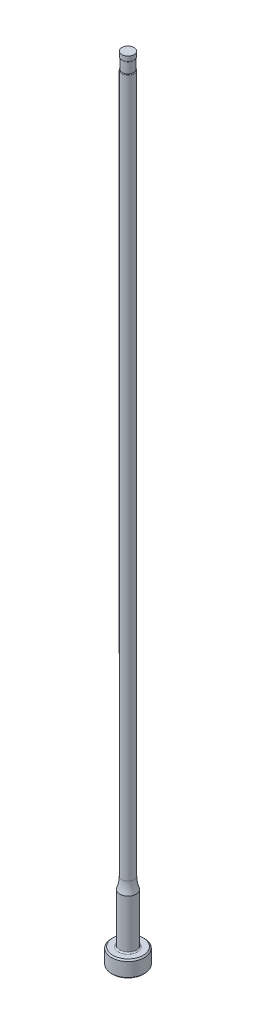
ISO-10303-21;
HEADER;
FILE_DESCRIPTION(('STEP AP214'),'2;1');
FILE_NAME('part.step','',(''),(''),'','','');
FILE_SCHEMA(('AUTOMOTIVE_DESIGN { 1 0 10303 214 1 1 1 1 }'));
ENDSEC;
DATA;
#1=APPLICATION_CONTEXT('core data for automotive mechanical design processes');
#2=APPLICATION_PROTOCOL_DEFINITION('international standard','automotive_design',2000,#1);
#3=PRODUCT_CONTEXT('',#1,'mechanical');
#4=PRODUCT('Part','Part','',(#3));
#5=PRODUCT_RELATED_PRODUCT_CATEGORY('part','',(#4));
#6=PRODUCT_DEFINITION_FORMATION('','',#4);
#7=PRODUCT_DEFINITION_CONTEXT('part definition',#1,'design');
#8=PRODUCT_DEFINITION('design','',#6,#7);
#9=PRODUCT_DEFINITION_SHAPE('','',#8);
#10=(LENGTH_UNIT() NAMED_UNIT(*) SI_UNIT(.MILLI.,.METRE.));
#11=(NAMED_UNIT(*) PLANE_ANGLE_UNIT() SI_UNIT($,.RADIAN.));
#12=(NAMED_UNIT(*) SI_UNIT($,.STERADIAN.) SOLID_ANGLE_UNIT());
#13=UNCERTAINTY_MEASURE_WITH_UNIT(LENGTH_MEASURE(1.E-05),#10,'distance_accuracy_value','');
#14=(GEOMETRIC_REPRESENTATION_CONTEXT(3) GLOBAL_UNCERTAINTY_ASSIGNED_CONTEXT((#13)) GLOBAL_UNIT_ASSIGNED_CONTEXT((#10,
#11,#12)) REPRESENTATION_CONTEXT('',''));
#15=CARTESIAN_POINT('',(0.,0.,0.));
#16=DIRECTION('',(0.,0.,1.));
#17=DIRECTION('',(1.,0.,0.));
#18=AXIS2_PLACEMENT_3D('',#15,#16,#17);
#19=CARTESIAN_POINT('',(0.,259.958771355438,0.));
#20=DIRECTION('',(0.,1.,0.));
#21=DIRECTION('',(0.,0.,1.));
#22=AXIS2_PLACEMENT_3D('',#19,#20,#21);
#23=CYLINDRICAL_SURFACE('',#22,1.18998999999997);
#24=DIRECTION('',(0.,1.,0.));
#25=VECTOR('',#24,1.);
#26=CARTESIAN_POINT('',(-1.08838999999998,259.958771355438,-0.481127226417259));
#27=LINE('',#26,#25);
#28=CARTESIAN_POINT('',(-1.08838999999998,149.227565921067,-0.481127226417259));
#29=VERTEX_POINT('',#28);
#30=CARTESIAN_POINT('',(-1.08838999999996,112.268,-0.481127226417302));
#31=VERTEX_POINT('',#30);
#32=EDGE_CURVE('E66',#29,#31,#27,.F.);
#33=ORIENTED_EDGE('',*,*,#32,.F.);
#34=CARTESIAN_POINT('',(0.,149.227565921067,0.));
#35=DIRECTION('',(0.,1.,0.));
#36=DIRECTION('',(0.,0.,1.));
#37=AXIS2_PLACEMENT_3D('',#34,#35,#36);
#38=CIRCLE('',#37,1.18998999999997);
#39=CARTESIAN_POINT('',(-1.08838999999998,149.227565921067,0.481127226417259));
#40=VERTEX_POINT('',#39);
#41=EDGE_CURVE('E44',#29,#40,#38,.F.);
#42=ORIENTED_EDGE('',*,*,#41,.T.);
#43=DIRECTION('',(0.,1.,0.));
#44=VECTOR('',#43,1.);
#45=CARTESIAN_POINT('',(-1.08838999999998,259.958771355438,0.481127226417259));
#46=LINE('',#45,#44);
#47=CARTESIAN_POINT('',(-1.08838999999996,112.268,0.481127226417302));
#48=VERTEX_POINT('',#47);
#49=EDGE_CURVE('E72',#48,#40,#46,.T.);
#50=ORIENTED_EDGE('',*,*,#49,.F.);
#51=CARTESIAN_POINT('',(-1.08838999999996,112.268,-0.481127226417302));
#52=CARTESIAN_POINT('',(-1.08838966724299,112.239183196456,-0.481120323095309));
#53=CARTESIAN_POINT('',(-1.08878297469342,112.210379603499,-0.480240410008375));
#54=CARTESIAN_POINT('',(-1.0903471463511,112.15287486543,-0.476680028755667));
#55=CARTESIAN_POINT('',(-1.09151883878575,112.124173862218,-0.473997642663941));
#56=CARTESIAN_POINT('',(-1.0962236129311,112.037732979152,-0.463079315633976));
#57=CARTESIAN_POINT('',(-1.10094613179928,111.980365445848,-0.451969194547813));
#58=CARTESIAN_POINT('',(-1.11171709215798,111.881397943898,-0.424640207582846));
#59=CARTESIAN_POINT('',(-1.11720060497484,111.839237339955,-0.41021369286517));
#60=CARTESIAN_POINT('',(-1.12939077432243,111.75775729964,-0.375363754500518));
#61=CARTESIAN_POINT('',(-1.13609165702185,111.71842562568,-0.354968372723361));
#62=CARTESIAN_POINT('',(-1.1472645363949,111.658969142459,-0.316366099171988));
#63=CARTESIAN_POINT('',(-1.15158336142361,111.637348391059,-0.300422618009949));
#64=CARTESIAN_POINT('',(-1.16012072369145,111.596602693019,-0.265553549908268));
#65=CARTESIAN_POINT('',(-1.16433935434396,111.577475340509,-0.246630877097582));
#66=CARTESIAN_POINT('',(-1.17139417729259,111.546625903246,-0.210179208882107));
#67=CARTESIAN_POINT('',(-1.17432972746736,111.534201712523,-0.193268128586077));
#68=CARTESIAN_POINT('',(-1.17964378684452,111.512180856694,-0.157607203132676));
#69=CARTESIAN_POINT('',(-1.18202305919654,111.502580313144,-0.138859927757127));
#70=CARTESIAN_POINT('',(-1.1856222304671,111.488246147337,-0.103155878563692));
#71=CARTESIAN_POINT('',(-1.1869702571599,111.482963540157,-0.0864338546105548));
#72=CARTESIAN_POINT('',(-1.18896221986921,111.475197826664,-0.05230931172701));
#73=CARTESIAN_POINT('',(-1.18960661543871,111.472712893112,-0.0349072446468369));
#74=CARTESIAN_POINT('',(-1.1901191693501,111.470734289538,0.000122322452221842));
#75=CARTESIAN_POINT('',(-1.18998545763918,111.471247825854,0.0177502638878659));
#76=CARTESIAN_POINT('',(-1.18895328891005,111.475240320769,0.0526432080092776));
#77=CARTESIAN_POINT('',(-1.18805460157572,111.478720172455,0.0699080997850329));
#78=CARTESIAN_POINT('',(-1.18562828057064,111.48823683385,0.103108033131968));
#79=CARTESIAN_POINT('',(-1.18411982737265,111.494195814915,0.11906720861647));
#80=CARTESIAN_POINT('',(-1.18061056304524,111.508296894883,0.149921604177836));
#81=CARTESIAN_POINT('',(-1.17860955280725,111.516439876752,0.164816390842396));
#82=CARTESIAN_POINT('',(-1.17313921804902,111.539184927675,0.200749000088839));
#83=CARTESIAN_POINT('',(-1.1694436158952,111.554956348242,0.221012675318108));
#84=CARTESIAN_POINT('',(-1.16168543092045,111.589494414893,0.258718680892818));
#85=CARTESIAN_POINT('',(-1.15762196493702,111.608268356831,0.276153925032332));
#86=CARTESIAN_POINT('',(-1.14734460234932,111.658227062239,0.316729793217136));
#87=CARTESIAN_POINT('',(-1.14110751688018,111.690801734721,0.338145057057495));
#88=CARTESIAN_POINT('',(-1.12927494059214,111.758924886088,0.375765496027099));
#89=CARTESIAN_POINT('',(-1.12368108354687,111.79448055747,0.391957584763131));
#90=CARTESIAN_POINT('',(-1.11078204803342,111.887330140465,0.427525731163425));
#91=CARTESIAN_POINT('',(-1.10420802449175,111.945901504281,0.443819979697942));
#92=CARTESIAN_POINT('',(-1.09432365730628,112.064957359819,0.467642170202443));
#93=CARTESIAN_POINT('',(-1.09101219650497,112.125441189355,0.475173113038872));
#94=CARTESIAN_POINT('',(-1.0890934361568,112.199778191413,0.479532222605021));
#95=CARTESIAN_POINT('',(-1.08882945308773,112.213431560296,0.480131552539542));
#96=CARTESIAN_POINT('',(-1.08847803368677,112.240722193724,0.480928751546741));
#97=CARTESIAN_POINT('',(-1.08839020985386,112.254359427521,0.481127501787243));
#98=CARTESIAN_POINT('',(-1.08838999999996,112.268,0.481127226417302));
#99=B_SPLINE_CURVE_WITH_KNOTS('',3,(#51,#52,#53,#54,#55,#56,#57,#58,#59,#60,#61,#62,#63,#64,#65,
#66,#67,#68,#69,#70,#71,#72,#73,#74,#75,#76,#77,#78,#79,#80,#81,#82,#83,#84,#85,#86,#87,#88,#89,
#90,#91,#92,#93,#94,#95,#96,#97,#98),.UNSPECIFIED.,.F.,.F.,(4,2,2,2,2,2,2,2,2,2,2,2,2,2,2,2,2,2,
2,2,2,2,2,4),(0.,0.0864065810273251,0.172905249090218,0.348016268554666,0.48234589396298,
0.616054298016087,0.697472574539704,0.778811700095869,0.842154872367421,0.905410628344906,
0.95794971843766,1.01045447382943,1.0630854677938,1.11573231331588,1.16683808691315,
1.21796455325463,1.29535063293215,1.37292769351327,1.49070506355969,1.60877526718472,
1.79125586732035,1.9736739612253,2.01467753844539,2.05559081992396),.UNSPECIFIED.);
#100=EDGE_CURVE('E74',#31,#48,#99,.T.);
#101=ORIENTED_EDGE('',*,*,#100,.F.);
#102=EDGE_LOOP('',(#33,#42,#50,#101));
#103=FACE_BOUND('',#102,.T.);
#104=CARTESIAN_POINT('',(0.,14.9114164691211,0.));
#105=DIRECTION('',(0.,1.,0.));
#106=DIRECTION('',(0.,0.,1.));
#107=AXIS2_PLACEMENT_3D('',#104,#105,#106);
#108=CIRCLE('',#107,1.18998999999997);
#109=CARTESIAN_POINT('',(0.,14.9114164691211,1.18998999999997));
#110=VERTEX_POINT('',#109);
#111=EDGE_CURVE('E95',#110,#110,#108,.T.);
#112=ORIENTED_EDGE('',*,*,#111,.T.);
#113=EDGE_LOOP('',(#112));
#114=FACE_BOUND('',#113,.T.);
#115=ADVANCED_FACE('F36',(#103,#114),#23,.T.);
#116=CARTESIAN_POINT('',(0.,14.9114164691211,0.));
#117=DIRECTION('',(0.,1.,0.));
#118=DIRECTION('',(0.,0.,1.));
#119=AXIS2_PLACEMENT_3D('',#116,#117,#118);
#120=TOROIDAL_SURFACE('',#119,7.53998999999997,6.35);
#121=CARTESIAN_POINT('',(0.,12.7,0.));
#122=DIRECTION('',(0.,1.,0.));
#123=DIRECTION('',(0.,0.,1.));
#124=AXIS2_PLACEMENT_3D('',#121,#122,#123);
#125=CIRCLE('',#124,1.58749999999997);
#126=CARTESIAN_POINT('',(0.,12.7,1.58749999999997));
#127=VERTEX_POINT('',#126);
#128=EDGE_CURVE('E92',#127,#127,#125,.T.);
#129=ORIENTED_EDGE('',*,*,#128,.T.);
#130=EDGE_LOOP('',(#129));
#131=FACE_BOUND('',#130,.T.);
#132=ORIENTED_EDGE('',*,*,#111,.F.);
#133=EDGE_LOOP('',(#132));
#134=FACE_BOUND('',#133,.T.);
#135=ADVANCED_FACE('F156',(#131,#134),#120,.F.);
#136=CARTESIAN_POINT('',(0.,259.958771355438,0.));
#137=DIRECTION('',(0.,1.,0.));
#138=DIRECTION('',(0.,0.,1.));
#139=AXIS2_PLACEMENT_3D('',#136,#137,#138);
#140=CYLINDRICAL_SURFACE('',#139,1.58749999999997);
#141=CARTESIAN_POINT('',(0.,3.42900000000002,0.));
#142=DIRECTION('',(0.,1.,0.));
#143=DIRECTION('',(0.,0.,1.));
#144=AXIS2_PLACEMENT_3D('',#141,#142,#143);
#145=CIRCLE('',#144,1.58749999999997);
#146=CARTESIAN_POINT('',(0.,3.42900000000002,1.58749999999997));
#147=VERTEX_POINT('',#146);
#148=EDGE_CURVE('E110',#147,#147,#145,.T.);
#149=ORIENTED_EDGE('',*,*,#148,.T.);
#150=EDGE_LOOP('',(#149));
#151=FACE_BOUND('',#150,.T.);
#152=ORIENTED_EDGE('',*,*,#128,.F.);
#153=EDGE_LOOP('',(#152));
#154=FACE_BOUND('',#153,.T.);
#155=ADVANCED_FACE('F153',(#151,#154),#140,.T.);
#156=CARTESIAN_POINT('',(-3.17499999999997,3.175,0.));
#157=DIRECTION('',(0.,1.,0.));
#158=DIRECTION('',(0.,0.,1.));
#159=AXIS2_PLACEMENT_3D('',#156,#157,#158);
#160=PLANE('',#159);
#161=CARTESIAN_POINT('',(0.,3.175,0.));
#162=DIRECTION('',(0.,1.,0.));
#163=DIRECTION('',(0.,0.,1.));
#164=AXIS2_PLACEMENT_3D('',#161,#162,#163);
#165=CIRCLE('',#164,1.84149999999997);
#166=CARTESIAN_POINT('',(0.,3.175,1.84149999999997));
#167=VERTEX_POINT('',#166);
#168=EDGE_CURVE('E78',#167,#167,#165,.F.);
#169=ORIENTED_EDGE('',*,*,#168,.T.);
#170=EDGE_LOOP('',(#169));
#171=FACE_BOUND('',#170,.T.);
#172=CARTESIAN_POINT('',(0.,3.175,0.));
#173=DIRECTION('',(0.,1.,0.));
#174=DIRECTION('',(0.,0.,1.));
#175=AXIS2_PLACEMENT_3D('',#172,#173,#174);
#176=CIRCLE('',#175,2.92099999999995);
#177=CARTESIAN_POINT('',(0.,3.175,2.92099999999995));
#178=VERTEX_POINT('',#177);
#179=EDGE_CURVE('E98',#178,#178,#176,.T.);
#180=ORIENTED_EDGE('',*,*,#179,.T.);
#181=EDGE_LOOP('',(#180));
#182=FACE_BOUND('',#181,.T.);
#183=ADVANCED_FACE('F149',(#171,#182),#160,.T.);
#184=CARTESIAN_POINT('',(0.,259.958771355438,0.));
#185=DIRECTION('',(0.,1.,0.));
#186=DIRECTION('',(0.,0.,1.));
#187=AXIS2_PLACEMENT_3D('',#184,#185,#186);
#188=CYLINDRICAL_SURFACE('',#187,3.17499999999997);
#189=CARTESIAN_POINT('',(0.,2.92100000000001,0.));
#190=DIRECTION('',(0.,1.,0.));
#191=DIRECTION('',(0.,0.,1.));
#192=AXIS2_PLACEMENT_3D('',#189,#190,#191);
#193=CIRCLE('',#192,3.17499999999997);
#194=CARTESIAN_POINT('',(0.,2.92100000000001,3.17499999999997));
#195=VERTEX_POINT('',#194);
#196=EDGE_CURVE('E104',#195,#195,#193,.F.);
#197=ORIENTED_EDGE('',*,*,#196,.T.);
#198=EDGE_LOOP('',(#197));
#199=FACE_BOUND('',#198,.T.);
#200=CARTESIAN_POINT('',(0.,0.254000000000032,0.));
#201=DIRECTION('',(0.,-1.,0.));
#202=DIRECTION('',(0.,0.,-1.));
#203=AXIS2_PLACEMENT_3D('',#200,#201,#202);
#204=CIRCLE('',#203,3.17499999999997);
#205=CARTESIAN_POINT('',(0.,0.254000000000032,-3.17499999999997));
#206=VERTEX_POINT('',#205);
#207=EDGE_CURVE('E101',#206,#206,#204,.F.);
#208=ORIENTED_EDGE('',*,*,#207,.T.);
#209=EDGE_LOOP('',(#208));
#210=FACE_BOUND('',#209,.T.);
#211=ADVANCED_FACE('F145',(#199,#210),#188,.T.);
#212=CARTESIAN_POINT('',(0.,0.,0.));
#213=DIRECTION('',(0.,-1.,0.));
#214=DIRECTION('',(0.,0.,-1.));
#215=AXIS2_PLACEMENT_3D('',#212,#213,#214);
#216=PLANE('',#215);
#217=CARTESIAN_POINT('',(0.,0.,0.));
#218=DIRECTION('',(0.,-1.,0.));
#219=DIRECTION('',(0.,0.,-1.));
#220=AXIS2_PLACEMENT_3D('',#217,#218,#219);
#221=CIRCLE('',#220,2.92099999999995);
#222=CARTESIAN_POINT('',(0.,0.,-2.92099999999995));
#223=VERTEX_POINT('',#222);
#224=EDGE_CURVE('E107',#223,#223,#221,.T.);
#225=ORIENTED_EDGE('',*,*,#224,.T.);
#226=EDGE_LOOP('',(#225));
#227=FACE_BOUND('',#226,.T.);
#228=ADVANCED_FACE('F141',(#227),#216,.T.);
#229=CARTESIAN_POINT('',(0.,3.17499999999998,0.));
#230=DIRECTION('',(0.,-1.,0.));
#231=DIRECTION('',(0.,0.,-1.));
#232=AXIS2_PLACEMENT_3D('',#229,#230,#231);
#233=CONICAL_SURFACE('',#232,2.92099999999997,0.7853981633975);
#234=ORIENTED_EDGE('',*,*,#196,.F.);
#235=EDGE_LOOP('',(#234));
#236=FACE_BOUND('',#235,.T.);
#237=ORIENTED_EDGE('',*,*,#179,.F.);
#238=EDGE_LOOP('',(#237));
#239=FACE_BOUND('',#238,.T.);
#240=ADVANCED_FACE('F144',(#236,#239),#233,.T.);
#241=CARTESIAN_POINT('',(0.,0.254000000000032,0.));
#242=DIRECTION('',(0.,1.,0.));
#243=DIRECTION('',(0.,0.,1.));
#244=AXIS2_PLACEMENT_3D('',#241,#242,#243);
#245=CONICAL_SURFACE('',#244,3.17499999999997,0.785398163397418);
#246=ORIENTED_EDGE('',*,*,#224,.F.);
#247=EDGE_LOOP('',(#246));
#248=FACE_BOUND('',#247,.T.);
#249=ORIENTED_EDGE('',*,*,#207,.F.);
#250=EDGE_LOOP('',(#249));
#251=FACE_BOUND('',#250,.T.);
#252=ADVANCED_FACE('F245',(#248,#251),#245,.T.);
#253=CARTESIAN_POINT('',(0.,3.42900000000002,0.));
#254=DIRECTION('',(0.,1.,0.));
#255=DIRECTION('',(0.,0.,1.));
#256=AXIS2_PLACEMENT_3D('',#253,#254,#255);
#257=TOROIDAL_SURFACE('',#256,1.84149999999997,0.254);
#258=ORIENTED_EDGE('',*,*,#168,.F.);
#259=EDGE_LOOP('',(#258));
#260=FACE_BOUND('',#259,.T.);
#261=ORIENTED_EDGE('',*,*,#148,.F.);
#262=EDGE_LOOP('',(#261));
#263=FACE_BOUND('',#262,.T.);
#264=ADVANCED_FACE('F139',(#260,#263),#257,.F.);
#265=CARTESIAN_POINT('',(0.,153.448281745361,0.));
#266=DIRECTION('',(0.,1.,0.));
#267=DIRECTION('',(0.,0.,1.));
#268=AXIS2_PLACEMENT_3D('',#265,#266,#267);
#269=CYLINDRICAL_SURFACE('',#268,1.08838999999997);
#270=CARTESIAN_POINT('',(0.,151.384,0.));
#271=DIRECTION('',(0.,1.,0.));
#272=DIRECTION('',(0.,0.,1.));
#273=AXIS2_PLACEMENT_3D('',#270,#271,#272);
#274=CIRCLE('',#273,1.08838999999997);
#275=CARTESIAN_POINT('',(0.,151.384,1.08838999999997));
#276=VERTEX_POINT('',#275);
#277=EDGE_CURVE('E71',#276,#276,#274,.T.);
#278=ORIENTED_EDGE('',*,*,#277,.F.);
#279=EDGE_LOOP('',(#278));
#280=FACE_BOUND('',#279,.T.);
#281=CARTESIAN_POINT('',(0.,149.352,0.));
#282=DIRECTION('',(0.,1.,0.));
#283=DIRECTION('',(0.,0.,1.));
#284=AXIS2_PLACEMENT_3D('',#281,#282,#283);
#285=CIRCLE('',#284,1.08838999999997);
#286=CARTESIAN_POINT('',(-1.08838999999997,149.352,0.));
#287=VERTEX_POINT('',#286);
#288=EDGE_CURVE('E89',#287,#287,#285,.T.);
#289=ORIENTED_EDGE('',*,*,#288,.T.);
#290=EDGE_LOOP('',(#289));
#291=FACE_BOUND('',#290,.T.);
#292=ADVANCED_FACE('F136',(#280,#291),#269,.T.);
#293=CARTESIAN_POINT('',(-1.08838999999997,150.368,-3.17499999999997));
#294=DIRECTION('',(1.,0.,0.));
#295=DIRECTION('',(0.,1.,0.));
#296=AXIS2_PLACEMENT_3D('',#293,#294,#295);
#297=PLANE('',#296);
#298=CARTESIAN_POINT('',(-1.08838999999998,149.227565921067,0.481127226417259));
#299=CARTESIAN_POINT('',(-1.08838999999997,149.230730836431,0.481135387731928));
#300=CARTESIAN_POINT('',(-1.08838999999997,149.233885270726,0.480835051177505));
#301=CARTESIAN_POINT('',(-1.08838999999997,149.24005903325,0.479692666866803));
#302=CARTESIAN_POINT('',(-1.08838999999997,149.243079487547,0.478856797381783));
#303=CARTESIAN_POINT('',(-1.08838999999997,149.249599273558,0.476477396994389));
#304=CARTESIAN_POINT('',(-1.08838999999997,149.253055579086,0.474817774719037));
#305=CARTESIAN_POINT('',(-1.08838999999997,149.25966384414,0.470958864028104));
#306=CARTESIAN_POINT('',(-1.08838999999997,149.262814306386,0.46875709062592));
#307=CARTESIAN_POINT('',(-1.08838999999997,149.270477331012,0.462614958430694));
#308=CARTESIAN_POINT('',(-1.08838999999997,149.274761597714,0.45839250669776));
#309=CARTESIAN_POINT('',(-1.08838999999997,149.282655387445,0.449369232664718));
#310=CARTESIAN_POINT('',(-1.08838999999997,149.286263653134,0.444567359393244));
#311=CARTESIAN_POINT('',(-1.08838999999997,149.296137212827,0.429819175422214));
#312=CARTESIAN_POINT('',(-1.08838999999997,149.301627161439,0.419360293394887));
#313=CARTESIAN_POINT('',(-1.08838999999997,149.311180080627,0.397821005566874));
#314=CARTESIAN_POINT('',(-1.08838999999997,149.315238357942,0.386738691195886));
#315=CARTESIAN_POINT('',(-1.08838999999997,149.326260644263,0.351899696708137));
#316=CARTESIAN_POINT('',(-1.08838999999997,149.331509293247,0.327613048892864));
#317=CARTESIAN_POINT('',(-1.08838999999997,149.339621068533,0.278627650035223));
#318=CARTESIAN_POINT('',(-1.08838999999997,149.342474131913,0.253927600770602));
#319=CARTESIAN_POINT('',(-1.08838999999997,149.346780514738,0.204271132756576));
#320=CARTESIAN_POINT('',(-1.08838999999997,149.34822603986,0.179314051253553));
#321=CARTESIAN_POINT('',(-1.08838999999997,149.350315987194,0.129366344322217));
#322=CARTESIAN_POINT('',(-1.08838999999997,149.350960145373,0.10437571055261));
#323=CARTESIAN_POINT('',(-1.08838999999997,149.351594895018,0.0661077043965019));
#324=CARTESIAN_POINT('',(-1.08838999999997,149.351750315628,0.0528328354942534));
#325=CARTESIAN_POINT('',(-1.08838999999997,149.351951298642,0.0263719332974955));
#326=CARTESIAN_POINT('',(-1.08838999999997,149.351997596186,0.0131859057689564));
#327=CARTESIAN_POINT('',(-1.08838999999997,149.352,0.));
#328=B_SPLINE_CURVE_WITH_KNOTS('',3,(#298,#299,#300,#301,#302,#303,#304,#305,#306,#307,#308,
#309,#310,#311,#312,#313,#314,#315,#316,#317,#318,#319,#320,#321,#322,#323,#324,#325,#326,#327),
.UNSPECIFIED.,.F.,.F.,(4,2,2,2,2,2,2,2,2,2,2,2,2,2,4),(0.,0.00946358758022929,
0.0188199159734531,0.0302585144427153,0.0417505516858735,0.0596944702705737,0.0776714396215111,
0.112909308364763,0.148261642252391,0.222508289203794,0.297065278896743,0.372032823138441,
0.447025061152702,0.486851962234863,0.526409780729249),.UNSPECIFIED.);
#329=EDGE_CURVE('E77',#40,#287,#328,.T.);
#330=ORIENTED_EDGE('',*,*,#329,.T.);
#331=CARTESIAN_POINT('',(-1.08838999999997,149.352,0.));
#332=CARTESIAN_POINT('',(-1.08838999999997,149.351979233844,-0.0211714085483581));
#333=CARTESIAN_POINT('',(-1.08838999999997,149.351872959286,-0.0423450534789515));
#334=CARTESIAN_POINT('',(-1.08838999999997,149.351341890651,-0.0847174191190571));
#335=CARTESIAN_POINT('',(-1.08838999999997,149.350916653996,-0.105916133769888));
#336=CARTESIAN_POINT('',(-1.08838999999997,149.349599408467,-0.148299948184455));
#337=CARTESIAN_POINT('',(-1.08838999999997,149.348707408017,-0.169485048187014));
#338=CARTESIAN_POINT('',(-1.08838999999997,149.346153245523,-0.211801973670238));
#339=CARTESIAN_POINT('',(-1.08838999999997,149.344491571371,-0.23293382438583));
#340=CARTESIAN_POINT('',(-1.08838999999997,149.3407838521,-0.267143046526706));
#341=CARTESIAN_POINT('',(-1.08838999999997,149.339117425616,-0.280260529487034));
#342=CARTESIAN_POINT('',(-1.08838999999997,149.335125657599,-0.306428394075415));
#343=CARTESIAN_POINT('',(-1.08838999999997,149.332798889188,-0.319478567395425));
#344=CARTESIAN_POINT('',(-1.08838999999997,149.326882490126,-0.347140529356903));
#345=CARTESIAN_POINT('',(-1.08838999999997,149.323164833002,-0.361725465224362));
#346=CARTESIAN_POINT('',(-1.08838999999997,149.314079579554,-0.390359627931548));
#347=CARTESIAN_POINT('',(-1.08838999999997,149.308719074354,-0.404410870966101));
#348=CARTESIAN_POINT('',(-1.08838999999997,149.299612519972,-0.422803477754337));
#349=CARTESIAN_POINT('',(-1.08838999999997,149.29697440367,-0.42768908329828));
#350=CARTESIAN_POINT('',(-1.08838999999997,149.291260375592,-0.437212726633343));
#351=CARTESIAN_POINT('',(-1.08838999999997,149.288183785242,-0.441850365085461));
#352=CARTESIAN_POINT('',(-1.08838999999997,149.281476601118,-0.45078486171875));
#353=CARTESIAN_POINT('',(-1.08838999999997,149.277840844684,-0.455077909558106));
#354=CARTESIAN_POINT('',(-1.08838999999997,149.269937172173,-0.463042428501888));
#355=CARTESIAN_POINT('',(-1.08838999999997,149.265671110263,-0.466715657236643));
#356=CARTESIAN_POINT('',(-1.08838999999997,149.258303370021,-0.47179758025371));
#357=CARTESIAN_POINT('',(-1.08838999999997,149.255421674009,-0.473523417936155));
#358=CARTESIAN_POINT('',(-1.08838999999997,149.249432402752,-0.476511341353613));
#359=CARTESIAN_POINT('',(-1.08838999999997,149.246325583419,-0.47777490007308));
#360=CARTESIAN_POINT('',(-1.08838999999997,149.240621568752,-0.479523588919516));
#361=CARTESIAN_POINT('',(-1.08838999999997,149.238057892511,-0.480117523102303));
#362=CARTESIAN_POINT('',(-1.08838999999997,149.232853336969,-0.480922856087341));
#363=CARTESIAN_POINT('',(-1.08838999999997,149.230212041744,-0.481131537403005));
#364=CARTESIAN_POINT('',(-1.08838999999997,149.227565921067,-0.481127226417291));
#365=B_SPLINE_CURVE_WITH_KNOTS('',3,(#331,#332,#333,#334,#335,#336,#337,#338,#339,#340,#341,
#342,#343,#344,#345,#346,#347,#348,#349,#350,#351,#352,#353,#354,#355,#356,#357,#358,#359,#360,
#361,#362,#363,#364),.UNSPECIFIED.,.F.,.F.,(4,2,2,2,2,2,2,2,2,2,2,2,2,2,2,2,4),(0.,
0.0635177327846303,0.127123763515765,0.190728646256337,0.254293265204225,0.293950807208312,
0.333694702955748,0.37880060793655,0.423714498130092,0.440354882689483,0.457021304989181,
0.473852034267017,0.490634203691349,0.500679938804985,0.510693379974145,0.518560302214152,
0.526482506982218),.UNSPECIFIED.);
#366=EDGE_CURVE('E58',#287,#29,#365,.T.);
#367=ORIENTED_EDGE('',*,*,#366,.T.);
#368=ORIENTED_EDGE('',*,*,#32,.T.);
#369=DIRECTION('',(0.,0.,1.));
#370=VECTOR('',#369,1.);
#371=CARTESIAN_POINT('',(-1.08838999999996,112.268,-3.17499999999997));
#372=LINE('',#371,#370);
#373=EDGE_CURVE('E70',#31,#48,#372,.T.);
#374=ORIENTED_EDGE('',*,*,#373,.T.);
#375=ORIENTED_EDGE('',*,*,#49,.T.);
#376=EDGE_LOOP('',(#330,#367,#368,#374,#375));
#377=FACE_BOUND('',#376,.T.);
#378=ADVANCED_FACE('F68',(#377),#297,.F.);
#379=CARTESIAN_POINT('',(-4.26338999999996,112.268,-3.17499999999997));
#380=DIRECTION('',(0.,0.,1.));
#381=DIRECTION('',(1.,0.,0.));
#382=AXIS2_PLACEMENT_3D('',#379,#380,#381);
#383=CYLINDRICAL_SURFACE('',#382,3.175);
#384=ORIENTED_EDGE('',*,*,#373,.F.);
#385=ORIENTED_EDGE('',*,*,#100,.T.);
#386=EDGE_LOOP('',(#384,#385));
#387=FACE_BOUND('',#386,.T.);
#388=ADVANCED_FACE('F80',(#387),#383,.F.);
#389=CARTESIAN_POINT('',(0.,152.687735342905,0.));
#390=DIRECTION('',(0.,1.,0.));
#391=DIRECTION('',(0.,0.,1.));
#392=AXIS2_PLACEMENT_3D('',#389,#390,#391);
#393=CYLINDRICAL_SURFACE('',#392,1.18490999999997);
#394=CARTESIAN_POINT('',(0.,151.507288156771,0.));
#395=DIRECTION('',(0.,-1.,0.));
#396=DIRECTION('',(0.,0.,-1.));
#397=AXIS2_PLACEMENT_3D('',#394,#395,#396);
#398=CIRCLE('',#397,1.18490999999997);
#399=CARTESIAN_POINT('',(0.,151.507288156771,-1.18490999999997));
#400=VERTEX_POINT('',#399);
#401=EDGE_CURVE('E11',#400,#400,#398,.F.);
#402=ORIENTED_EDGE('',*,*,#401,.T.);
#403=EDGE_LOOP('',(#402));
#404=FACE_BOUND('',#403,.T.);
#405=CARTESIAN_POINT('',(0.,152.4,0.));
#406=DIRECTION('',(0.,1.,0.));
#407=DIRECTION('',(0.,0.,1.));
#408=AXIS2_PLACEMENT_3D('',#405,#406,#407);
#409=CIRCLE('',#408,1.18490999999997);
#410=CARTESIAN_POINT('',(0.,152.4,1.18490999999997));
#411=VERTEX_POINT('',#410);
#412=EDGE_CURVE('E81',#411,#411,#409,.T.);
#413=ORIENTED_EDGE('',*,*,#412,.F.);
#414=EDGE_LOOP('',(#413));
#415=FACE_BOUND('',#414,.T.);
#416=ADVANCED_FACE('F133',(#404,#415),#393,.T.);
#417=CARTESIAN_POINT('',(-1.18998999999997,152.4,0.));
#418=DIRECTION('',(0.,1.,0.));
#419=DIRECTION('',(0.,0.,1.));
#420=AXIS2_PLACEMENT_3D('',#417,#418,#419);
#421=PLANE('',#420);
#422=ORIENTED_EDGE('',*,*,#412,.T.);
#423=EDGE_LOOP('',(#422));
#424=FACE_BOUND('',#423,.T.);
#425=ADVANCED_FACE('F177',(#424),#421,.T.);
#426=CARTESIAN_POINT('',(0.,149.227565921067,0.));
#427=DIRECTION('',(0.,1.,0.));
#428=DIRECTION('',(0.,0.,1.));
#429=AXIS2_PLACEMENT_3D('',#426,#427,#428);
#430=TOROIDAL_SURFACE('',#429,1.06298999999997,0.127);
#431=ORIENTED_EDGE('',*,*,#329,.F.);
#432=ORIENTED_EDGE('',*,*,#41,.F.);
#433=ORIENTED_EDGE('',*,*,#366,.F.);
#434=ORIENTED_EDGE('',*,*,#288,.F.);
#435=EDGE_LOOP('',(#431,#432,#433,#434));
#436=FACE_BOUND('',#435,.T.);
#437=ADVANCED_FACE('F209',(#436),#430,.T.);
#438=CARTESIAN_POINT('',(0.,151.507288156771,0.));
#439=DIRECTION('',(0.,-1.,0.));
#440=DIRECTION('',(0.,0.,-1.));
#441=AXIS2_PLACEMENT_3D('',#438,#439,#440);
#442=TOROIDAL_SURFACE('',#441,1.05790999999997,0.127);
#443=ORIENTED_EDGE('',*,*,#277,.T.);
#444=EDGE_LOOP('',(#443));
#445=FACE_BOUND('',#444,.T.);
#446=ORIENTED_EDGE('',*,*,#401,.F.);
#447=EDGE_LOOP('',(#446));
#448=FACE_BOUND('',#447,.T.);
#449=ADVANCED_FACE('F38',(#445,#448),#442,.T.);
#450=CLOSED_SHELL('',(#115,#135,#155,#183,#211,#228,#240,#252,#264,#292,#378,#388,#416,#425,
#437,#449));
#451=MANIFOLD_SOLID_BREP('B2',#450);
#452=ADVANCED_BREP_SHAPE_REPRESENTATION('',(#18,#451),#14);
#453=SHAPE_DEFINITION_REPRESENTATION(#9,#452);
ENDSEC;
END-ISO-10303-21;
